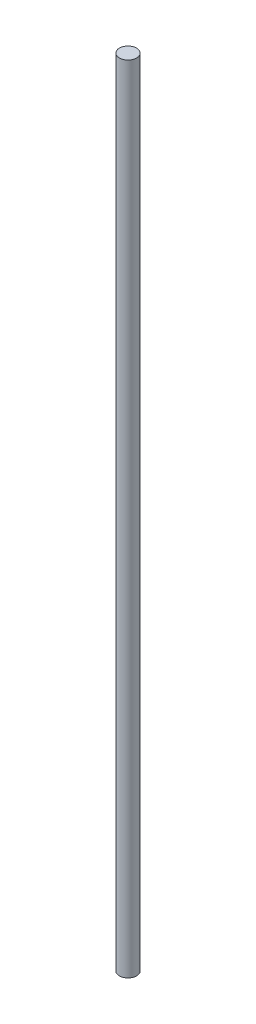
ISO-10303-21;
HEADER;
FILE_DESCRIPTION(('STEP AP214'),'2;1');
FILE_NAME('part.step','',(''),(''),'','','');
FILE_SCHEMA(('AUTOMOTIVE_DESIGN { 1 0 10303 214 1 1 1 1 }'));
ENDSEC;
DATA;
#1=APPLICATION_CONTEXT('core data for automotive mechanical design processes');
#2=APPLICATION_PROTOCOL_DEFINITION('international standard','automotive_design',2000,#1);
#3=PRODUCT_CONTEXT('',#1,'mechanical');
#4=PRODUCT('Part','Part','',(#3));
#5=PRODUCT_RELATED_PRODUCT_CATEGORY('part','',(#4));
#6=PRODUCT_DEFINITION_FORMATION('','',#4);
#7=PRODUCT_DEFINITION_CONTEXT('part definition',#1,'design');
#8=PRODUCT_DEFINITION('design','',#6,#7);
#9=PRODUCT_DEFINITION_SHAPE('','',#8);
#10=(LENGTH_UNIT() NAMED_UNIT(*) SI_UNIT(.MILLI.,.METRE.));
#11=(NAMED_UNIT(*) PLANE_ANGLE_UNIT() SI_UNIT($,.RADIAN.));
#12=(NAMED_UNIT(*) SI_UNIT($,.STERADIAN.) SOLID_ANGLE_UNIT());
#13=UNCERTAINTY_MEASURE_WITH_UNIT(LENGTH_MEASURE(1.E-05),#10,'distance_accuracy_value','');
#14=(GEOMETRIC_REPRESENTATION_CONTEXT(3) GLOBAL_UNCERTAINTY_ASSIGNED_CONTEXT((#13)) GLOBAL_UNIT_ASSIGNED_CONTEXT((#10,
#11,#12)) REPRESENTATION_CONTEXT('',''));
#15=CARTESIAN_POINT('',(0.,0.,0.));
#16=DIRECTION('',(0.,0.,1.));
#17=DIRECTION('',(1.,0.,0.));
#18=AXIS2_PLACEMENT_3D('',#15,#16,#17);
#19=CARTESIAN_POINT('',(0.,185.,0.));
#20=DIRECTION('',(0.,-1.,0.));
#21=DIRECTION('',(0.,0.,-1.));
#22=AXIS2_PLACEMENT_3D('',#19,#20,#21);
#23=CYLINDRICAL_SURFACE('',#22,2.);
#24=CARTESIAN_POINT('',(0.,185.,0.));
#25=DIRECTION('',(0.,1.,0.));
#26=DIRECTION('',(0.,0.,1.));
#27=AXIS2_PLACEMENT_3D('',#24,#25,#26);
#28=CIRCLE('',#27,2.);
#29=CARTESIAN_POINT('',(0.,185.,2.));
#30=VERTEX_POINT('',#29);
#31=EDGE_CURVE('E10',#30,#30,#28,.T.);
#32=ORIENTED_EDGE('',*,*,#31,.F.);
#33=EDGE_LOOP('',(#32));
#34=FACE_BOUND('',#33,.T.);
#35=CARTESIAN_POINT('',(0.,0.,0.));
#36=DIRECTION('',(0.,1.,0.));
#37=DIRECTION('',(0.,0.,1.));
#38=AXIS2_PLACEMENT_3D('',#35,#36,#37);
#39=CIRCLE('',#38,2.);
#40=CARTESIAN_POINT('',(0.,0.,2.));
#41=VERTEX_POINT('',#40);
#42=EDGE_CURVE('E34',#41,#41,#39,.T.);
#43=ORIENTED_EDGE('',*,*,#42,.T.);
#44=EDGE_LOOP('',(#43));
#45=FACE_BOUND('',#44,.T.);
#46=ADVANCED_FACE('F31',(#34,#45),#23,.T.);
#47=CARTESIAN_POINT('',(0.,185.,0.));
#48=DIRECTION('',(0.,1.,0.));
#49=DIRECTION('',(0.,0.,1.));
#50=AXIS2_PLACEMENT_3D('',#47,#48,#49);
#51=PLANE('',#50);
#52=ORIENTED_EDGE('',*,*,#31,.T.);
#53=EDGE_LOOP('',(#52));
#54=FACE_BOUND('',#53,.T.);
#55=ADVANCED_FACE('F46',(#54),#51,.T.);
#56=CARTESIAN_POINT('',(0.,0.,0.));
#57=DIRECTION('',(0.,1.,0.));
#58=DIRECTION('',(0.,0.,1.));
#59=AXIS2_PLACEMENT_3D('',#56,#57,#58);
#60=PLANE('',#59);
#61=ORIENTED_EDGE('',*,*,#42,.F.);
#62=EDGE_LOOP('',(#61));
#63=FACE_BOUND('',#62,.T.);
#64=ADVANCED_FACE('F44',(#63),#60,.F.);
#65=CLOSED_SHELL('',(#46,#55,#64));
#66=MANIFOLD_SOLID_BREP('B2',#65);
#67=ADVANCED_BREP_SHAPE_REPRESENTATION('',(#18,#66),#14);
#68=SHAPE_DEFINITION_REPRESENTATION(#9,#67);
ENDSEC;
END-ISO-10303-21;
